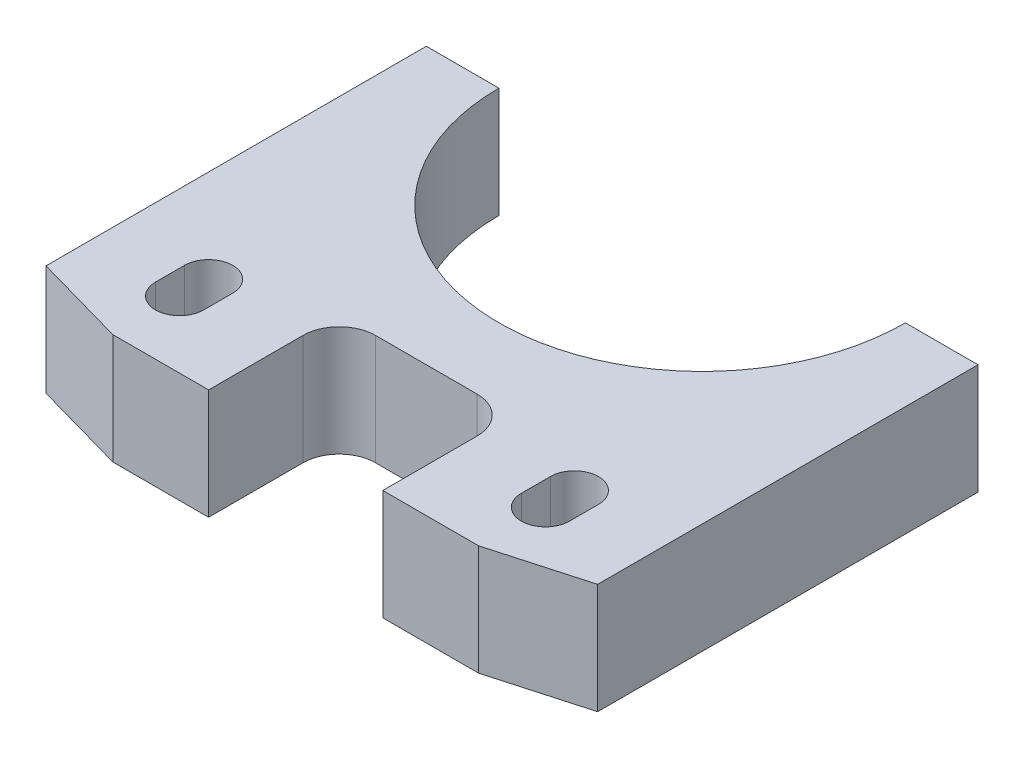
ISO-10303-21;
HEADER;
FILE_DESCRIPTION(('STEP AP214'),'2;1');
FILE_NAME('part.step','',(''),(''),'','','');
FILE_SCHEMA(('AUTOMOTIVE_DESIGN { 1 0 10303 214 1 1 1 1 }'));
ENDSEC;
DATA;
#1=APPLICATION_CONTEXT('core data for automotive mechanical design processes');
#2=APPLICATION_PROTOCOL_DEFINITION('international standard','automotive_design',2000,#1);
#3=PRODUCT_CONTEXT('',#1,'mechanical');
#4=PRODUCT('Part','Part','',(#3));
#5=PRODUCT_RELATED_PRODUCT_CATEGORY('part','',(#4));
#6=PRODUCT_DEFINITION_FORMATION('','',#4);
#7=PRODUCT_DEFINITION_CONTEXT('part definition',#1,'design');
#8=PRODUCT_DEFINITION('design','',#6,#7);
#9=PRODUCT_DEFINITION_SHAPE('','',#8);
#10=(LENGTH_UNIT() NAMED_UNIT(*) SI_UNIT(.MILLI.,.METRE.));
#11=(NAMED_UNIT(*) PLANE_ANGLE_UNIT() SI_UNIT($,.RADIAN.));
#12=(NAMED_UNIT(*) SI_UNIT($,.STERADIAN.) SOLID_ANGLE_UNIT());
#13=UNCERTAINTY_MEASURE_WITH_UNIT(LENGTH_MEASURE(1.E-05),#10,'distance_accuracy_value','');
#14=(GEOMETRIC_REPRESENTATION_CONTEXT(3) GLOBAL_UNCERTAINTY_ASSIGNED_CONTEXT((#13)) GLOBAL_UNIT_ASSIGNED_CONTEXT((#10,
#11,#12)) REPRESENTATION_CONTEXT('',''));
#15=CARTESIAN_POINT('',(0.,0.,0.));
#16=DIRECTION('',(0.,0.,1.));
#17=DIRECTION('',(1.,0.,0.));
#18=AXIS2_PLACEMENT_3D('',#15,#16,#17);
#19=CARTESIAN_POINT('',(0.,9.652,22.86));
#20=DIRECTION('',(0.,1.,0.));
#21=DIRECTION('',(0.,0.,1.));
#22=AXIS2_PLACEMENT_3D('',#19,#20,#21);
#23=PLANE('',#22);
#24=DIRECTION('',(0.,0.,-1.));
#25=VECTOR('',#24,1.);
#26=CARTESIAN_POINT('',(-13.8938,9.652,52.578));
#27=LINE('',#26,#25);
#28=CARTESIAN_POINT('',(-13.8938,9.652,52.578));
#29=VERTEX_POINT('',#28);
#30=CARTESIAN_POINT('',(-13.8938,9.652,50.038));
#31=VERTEX_POINT('',#30);
#32=EDGE_CURVE('E237',#29,#31,#27,.T.);
#33=ORIENTED_EDGE('',*,*,#32,.F.);
#34=CARTESIAN_POINT('',(-16.002,9.652,52.578));
#35=DIRECTION('',(0.,1.,0.));
#36=DIRECTION('',(0.,0.,-1.));
#37=AXIS2_PLACEMENT_3D('',#34,#35,#36);
#38=CIRCLE('',#37,2.1082);
#39=CARTESIAN_POINT('',(-18.1102,9.652,52.578));
#40=VERTEX_POINT('',#39);
#41=EDGE_CURVE('E235',#40,#29,#38,.T.);
#42=ORIENTED_EDGE('',*,*,#41,.F.);
#43=DIRECTION('',(0.,0.,1.));
#44=VECTOR('',#43,1.);
#45=CARTESIAN_POINT('',(-18.1102,9.652,52.578));
#46=LINE('',#45,#44);
#47=CARTESIAN_POINT('',(-18.1102,9.652,50.038));
#48=VERTEX_POINT('',#47);
#49=EDGE_CURVE('E242',#48,#40,#46,.T.);
#50=ORIENTED_EDGE('',*,*,#49,.F.);
#51=CARTESIAN_POINT('',(-16.002,9.652,50.038));
#52=DIRECTION('',(0.,1.,0.));
#53=DIRECTION('',(0.,0.,-1.));
#54=AXIS2_PLACEMENT_3D('',#51,#52,#53);
#55=CIRCLE('',#54,2.1082);
#56=EDGE_CURVE('E239',#31,#48,#55,.T.);
#57=ORIENTED_EDGE('',*,*,#56,.F.);
#58=EDGE_LOOP('',(#33,#42,#50,#57));
#59=FACE_BOUND('',#58,.T.);
#60=CARTESIAN_POINT('',(0.,9.652,22.86));
#61=DIRECTION('',(0.,-1.,0.));
#62=DIRECTION('',(0.,0.,1.));
#63=AXIS2_PLACEMENT_3D('',#60,#61,#62);
#64=CIRCLE('',#63,17.78);
#65=CARTESIAN_POINT('',(17.78,9.652,22.86));
#66=VERTEX_POINT('',#65);
#67=CARTESIAN_POINT('',(-17.78,9.652,22.86));
#68=VERTEX_POINT('',#67);
#69=EDGE_CURVE('E283',#66,#68,#64,.T.);
#70=ORIENTED_EDGE('',*,*,#69,.T.);
#71=DIRECTION('',(-1.,0.,0.));
#72=VECTOR('',#71,1.);
#73=CARTESIAN_POINT('',(-17.78,9.652,22.86));
#74=LINE('',#73,#72);
#75=CARTESIAN_POINT('',(-24.13,9.652,22.86));
#76=VERTEX_POINT('',#75);
#77=EDGE_CURVE('E286',#68,#76,#74,.T.);
#78=ORIENTED_EDGE('',*,*,#77,.T.);
#79=DIRECTION('',(0.,0.,1.));
#80=VECTOR('',#79,1.);
#81=CARTESIAN_POINT('',(-24.13,9.652,22.86));
#82=LINE('',#81,#80);
#83=CARTESIAN_POINT('',(-24.13,9.652,56.134));
#84=VERTEX_POINT('',#83);
#85=EDGE_CURVE('E288',#76,#84,#82,.T.);
#86=ORIENTED_EDGE('',*,*,#85,.T.);
#87=DIRECTION('',(0.962650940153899,0.,0.270745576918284));
#88=VECTOR('',#87,1.);
#89=CARTESIAN_POINT('',(-16.002,9.652,58.42));
#90=LINE('',#89,#88);
#91=CARTESIAN_POINT('',(-16.002,9.652,58.42));
#92=VERTEX_POINT('',#91);
#93=EDGE_CURVE('E290',#84,#92,#90,.T.);
#94=ORIENTED_EDGE('',*,*,#93,.T.);
#95=DIRECTION('',(1.,0.,0.));
#96=VECTOR('',#95,1.);
#97=CARTESIAN_POINT('',(-7.62000000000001,9.652,58.42));
#98=LINE('',#97,#96);
#99=CARTESIAN_POINT('',(-7.62000000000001,9.652,58.42));
#100=VERTEX_POINT('',#99);
#101=EDGE_CURVE('E292',#92,#100,#98,.T.);
#102=ORIENTED_EDGE('',*,*,#101,.T.);
#103=DIRECTION('',(0.,0.,-1.));
#104=VECTOR('',#103,1.);
#105=CARTESIAN_POINT('',(-7.62000000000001,9.652,58.42));
#106=LINE('',#105,#104);
#107=CARTESIAN_POINT('',(-7.62,9.652,50.165));
#108=VERTEX_POINT('',#107);
#109=EDGE_CURVE('E294',#100,#108,#106,.T.);
#110=ORIENTED_EDGE('',*,*,#109,.T.);
#111=CARTESIAN_POINT('',(-4.445,9.652,50.165));
#112=DIRECTION('',(0.,-1.,0.));
#113=DIRECTION('',(0.,0.,-1.));
#114=AXIS2_PLACEMENT_3D('',#111,#112,#113);
#115=CIRCLE('',#114,3.175);
#116=CARTESIAN_POINT('',(-4.445,9.652,46.99));
#117=VERTEX_POINT('',#116);
#118=EDGE_CURVE('E296',#108,#117,#115,.T.);
#119=ORIENTED_EDGE('',*,*,#118,.T.);
#120=DIRECTION('',(1.,0.,0.));
#121=VECTOR('',#120,1.);
#122=CARTESIAN_POINT('',(4.445,9.652,46.99));
#123=LINE('',#122,#121);
#124=CARTESIAN_POINT('',(4.445,9.652,46.99));
#125=VERTEX_POINT('',#124);
#126=EDGE_CURVE('E298',#117,#125,#123,.T.);
#127=ORIENTED_EDGE('',*,*,#126,.T.);
#128=CARTESIAN_POINT('',(4.445,9.652,50.165));
#129=DIRECTION('',(0.,-1.,0.));
#130=DIRECTION('',(0.,0.,1.));
#131=AXIS2_PLACEMENT_3D('',#128,#129,#130);
#132=CIRCLE('',#131,3.175);
#133=CARTESIAN_POINT('',(7.62000000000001,9.652,50.165));
#134=VERTEX_POINT('',#133);
#135=EDGE_CURVE('E300',#125,#134,#132,.T.);
#136=ORIENTED_EDGE('',*,*,#135,.T.);
#137=DIRECTION('',(0.,0.,1.));
#138=VECTOR('',#137,1.);
#139=CARTESIAN_POINT('',(7.62000000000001,9.652,58.42));
#140=LINE('',#139,#138);
#141=CARTESIAN_POINT('',(7.62000000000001,9.652,58.42));
#142=VERTEX_POINT('',#141);
#143=EDGE_CURVE('E302',#134,#142,#140,.T.);
#144=ORIENTED_EDGE('',*,*,#143,.T.);
#145=DIRECTION('',(1.,0.,0.));
#146=VECTOR('',#145,1.);
#147=CARTESIAN_POINT('',(7.62000000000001,9.652,58.42));
#148=LINE('',#147,#146);
#149=CARTESIAN_POINT('',(16.002,9.652,58.42));
#150=VERTEX_POINT('',#149);
#151=EDGE_CURVE('E304',#142,#150,#148,.T.);
#152=ORIENTED_EDGE('',*,*,#151,.T.);
#153=DIRECTION('',(0.962650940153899,0.,-0.270745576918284));
#154=VECTOR('',#153,1.);
#155=CARTESIAN_POINT('',(16.002,9.652,58.42));
#156=LINE('',#155,#154);
#157=CARTESIAN_POINT('',(24.13,9.652,56.134));
#158=VERTEX_POINT('',#157);
#159=EDGE_CURVE('E306',#150,#158,#156,.T.);
#160=ORIENTED_EDGE('',*,*,#159,.T.);
#161=DIRECTION('',(0.,0.,-1.));
#162=VECTOR('',#161,1.);
#163=CARTESIAN_POINT('',(24.13,9.652,22.86));
#164=LINE('',#163,#162);
#165=CARTESIAN_POINT('',(24.13,9.652,22.86));
#166=VERTEX_POINT('',#165);
#167=EDGE_CURVE('E308',#158,#166,#164,.T.);
#168=ORIENTED_EDGE('',*,*,#167,.T.);
#169=DIRECTION('',(-1.,0.,0.));
#170=VECTOR('',#169,1.);
#171=CARTESIAN_POINT('',(17.78,9.652,22.86));
#172=LINE('',#171,#170);
#173=EDGE_CURVE('E310',#166,#66,#172,.T.);
#174=ORIENTED_EDGE('',*,*,#173,.T.);
#175=EDGE_LOOP('',(#70,#78,#86,#94,#102,#110,#119,#127,#136,#144,#152,#160,#168,#174));
#176=FACE_BOUND('',#175,.T.);
#177=DIRECTION('',(0.,0.,-1.));
#178=VECTOR('',#177,1.);
#179=CARTESIAN_POINT('',(18.1102,9.652,52.578));
#180=LINE('',#179,#178);
#181=CARTESIAN_POINT('',(18.1102,9.652,52.578));
#182=VERTEX_POINT('',#181);
#183=CARTESIAN_POINT('',(18.1102,9.652,50.038));
#184=VERTEX_POINT('',#183);
#185=EDGE_CURVE('E214',#182,#184,#180,.T.);
#186=ORIENTED_EDGE('',*,*,#185,.F.);
#187=CARTESIAN_POINT('',(16.002,9.652,52.578));
#188=DIRECTION('',(0.,1.,0.));
#189=DIRECTION('',(0.,0.,1.));
#190=AXIS2_PLACEMENT_3D('',#187,#188,#189);
#191=CIRCLE('',#190,2.1082);
#192=CARTESIAN_POINT('',(13.8938,9.652,52.578));
#193=VERTEX_POINT('',#192);
#194=EDGE_CURVE('E198',#193,#182,#191,.T.);
#195=ORIENTED_EDGE('',*,*,#194,.F.);
#196=DIRECTION('',(0.,0.,1.));
#197=VECTOR('',#196,1.);
#198=CARTESIAN_POINT('',(13.8938,9.652,52.578));
#199=LINE('',#198,#197);
#200=CARTESIAN_POINT('',(13.8938,9.652,50.038));
#201=VERTEX_POINT('',#200);
#202=EDGE_CURVE('E218',#201,#193,#199,.T.);
#203=ORIENTED_EDGE('',*,*,#202,.F.);
#204=CARTESIAN_POINT('',(16.002,9.652,50.038));
#205=DIRECTION('',(0.,1.,0.));
#206=DIRECTION('',(0.,0.,1.));
#207=AXIS2_PLACEMENT_3D('',#204,#205,#206);
#208=CIRCLE('',#207,2.1082);
#209=EDGE_CURVE('E216',#184,#201,#208,.T.);
#210=ORIENTED_EDGE('',*,*,#209,.F.);
#211=EDGE_LOOP('',(#186,#195,#203,#210));
#212=FACE_BOUND('',#211,.T.);
#213=ADVANCED_FACE('F34',(#59,#176,#212),#23,.T.);
#214=CARTESIAN_POINT('',(0.,0.,22.86));
#215=DIRECTION('',(0.,1.,0.));
#216=DIRECTION('',(0.,0.,1.));
#217=AXIS2_PLACEMENT_3D('',#214,#215,#216);
#218=PLANE('',#217);
#219=CARTESIAN_POINT('',(-16.002,0.,52.578));
#220=DIRECTION('',(0.,1.,0.));
#221=DIRECTION('',(0.,0.,-1.));
#222=AXIS2_PLACEMENT_3D('',#219,#220,#221);
#223=CIRCLE('',#222,2.1082);
#224=CARTESIAN_POINT('',(-18.1102,0.,52.578));
#225=VERTEX_POINT('',#224);
#226=CARTESIAN_POINT('',(-13.8938,0.,52.578));
#227=VERTEX_POINT('',#226);
#228=EDGE_CURVE('E199',#225,#227,#223,.T.);
#229=ORIENTED_EDGE('',*,*,#228,.T.);
#230=DIRECTION('',(0.,0.,-1.));
#231=VECTOR('',#230,1.);
#232=CARTESIAN_POINT('',(-13.8938,0.,52.578));
#233=LINE('',#232,#231);
#234=CARTESIAN_POINT('',(-13.8938,0.,50.038));
#235=VERTEX_POINT('',#234);
#236=EDGE_CURVE('E226',#227,#235,#233,.T.);
#237=ORIENTED_EDGE('',*,*,#236,.T.);
#238=CARTESIAN_POINT('',(-16.002,0.,50.038));
#239=DIRECTION('',(0.,1.,0.));
#240=DIRECTION('',(0.,0.,-1.));
#241=AXIS2_PLACEMENT_3D('',#238,#239,#240);
#242=CIRCLE('',#241,2.1082);
#243=CARTESIAN_POINT('',(-18.1102,0.,50.038));
#244=VERTEX_POINT('',#243);
#245=EDGE_CURVE('E229',#235,#244,#242,.T.);
#246=ORIENTED_EDGE('',*,*,#245,.T.);
#247=DIRECTION('',(0.,0.,1.));
#248=VECTOR('',#247,1.);
#249=CARTESIAN_POINT('',(-18.1102,0.,52.578));
#250=LINE('',#249,#248);
#251=EDGE_CURVE('E232',#244,#225,#250,.T.);
#252=ORIENTED_EDGE('',*,*,#251,.T.);
#253=EDGE_LOOP('',(#229,#237,#246,#252));
#254=FACE_BOUND('',#253,.T.);
#255=CARTESIAN_POINT('',(0.,0.,22.86));
#256=DIRECTION('',(0.,-1.,0.));
#257=DIRECTION('',(0.,0.,1.));
#258=AXIS2_PLACEMENT_3D('',#255,#256,#257);
#259=CIRCLE('',#258,17.78);
#260=CARTESIAN_POINT('',(17.78,0.,22.86));
#261=VERTEX_POINT('',#260);
#262=CARTESIAN_POINT('',(-17.78,0.,22.86));
#263=VERTEX_POINT('',#262);
#264=EDGE_CURVE('E254',#261,#263,#259,.T.);
#265=ORIENTED_EDGE('',*,*,#264,.F.);
#266=DIRECTION('',(-1.,0.,0.));
#267=VECTOR('',#266,1.);
#268=CARTESIAN_POINT('',(17.78,0.,22.86));
#269=LINE('',#268,#267);
#270=CARTESIAN_POINT('',(24.13,0.,22.86));
#271=VERTEX_POINT('',#270);
#272=EDGE_CURVE('E281',#271,#261,#269,.T.);
#273=ORIENTED_EDGE('',*,*,#272,.F.);
#274=DIRECTION('',(0.,0.,-1.));
#275=VECTOR('',#274,1.);
#276=CARTESIAN_POINT('',(24.13,0.,22.86));
#277=LINE('',#276,#275);
#278=CARTESIAN_POINT('',(24.13,0.,56.134));
#279=VERTEX_POINT('',#278);
#280=EDGE_CURVE('E279',#279,#271,#277,.T.);
#281=ORIENTED_EDGE('',*,*,#280,.F.);
#282=DIRECTION('',(0.962650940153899,0.,-0.270745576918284));
#283=VECTOR('',#282,1.);
#284=CARTESIAN_POINT('',(16.002,0.,58.42));
#285=LINE('',#284,#283);
#286=CARTESIAN_POINT('',(16.002,0.,58.42));
#287=VERTEX_POINT('',#286);
#288=EDGE_CURVE('E277',#287,#279,#285,.T.);
#289=ORIENTED_EDGE('',*,*,#288,.F.);
#290=DIRECTION('',(1.,0.,0.));
#291=VECTOR('',#290,1.);
#292=CARTESIAN_POINT('',(7.62000000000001,0.,58.42));
#293=LINE('',#292,#291);
#294=CARTESIAN_POINT('',(7.62000000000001,0.,58.42));
#295=VERTEX_POINT('',#294);
#296=EDGE_CURVE('E275',#295,#287,#293,.T.);
#297=ORIENTED_EDGE('',*,*,#296,.F.);
#298=DIRECTION('',(0.,0.,1.));
#299=VECTOR('',#298,1.);
#300=CARTESIAN_POINT('',(7.62000000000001,0.,58.42));
#301=LINE('',#300,#299);
#302=CARTESIAN_POINT('',(7.62000000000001,0.,50.165));
#303=VERTEX_POINT('',#302);
#304=EDGE_CURVE('E273',#303,#295,#301,.T.);
#305=ORIENTED_EDGE('',*,*,#304,.F.);
#306=CARTESIAN_POINT('',(4.445,0.,50.165));
#307=DIRECTION('',(0.,-1.,0.));
#308=DIRECTION('',(0.,0.,1.));
#309=AXIS2_PLACEMENT_3D('',#306,#307,#308);
#310=CIRCLE('',#309,3.175);
#311=CARTESIAN_POINT('',(4.445,0.,46.99));
#312=VERTEX_POINT('',#311);
#313=EDGE_CURVE('E271',#312,#303,#310,.T.);
#314=ORIENTED_EDGE('',*,*,#313,.F.);
#315=DIRECTION('',(1.,0.,0.));
#316=VECTOR('',#315,1.);
#317=CARTESIAN_POINT('',(4.445,0.,46.99));
#318=LINE('',#317,#316);
#319=CARTESIAN_POINT('',(-4.445,0.,46.99));
#320=VERTEX_POINT('',#319);
#321=EDGE_CURVE('E269',#320,#312,#318,.T.);
#322=ORIENTED_EDGE('',*,*,#321,.F.);
#323=CARTESIAN_POINT('',(-4.445,0.,50.165));
#324=DIRECTION('',(0.,-1.,0.));
#325=DIRECTION('',(0.,0.,-1.));
#326=AXIS2_PLACEMENT_3D('',#323,#324,#325);
#327=CIRCLE('',#326,3.175);
#328=CARTESIAN_POINT('',(-7.62,0.,50.165));
#329=VERTEX_POINT('',#328);
#330=EDGE_CURVE('E267',#329,#320,#327,.T.);
#331=ORIENTED_EDGE('',*,*,#330,.F.);
#332=DIRECTION('',(0.,0.,-1.));
#333=VECTOR('',#332,1.);
#334=CARTESIAN_POINT('',(-7.62000000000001,0.,58.42));
#335=LINE('',#334,#333);
#336=CARTESIAN_POINT('',(-7.62000000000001,0.,58.42));
#337=VERTEX_POINT('',#336);
#338=EDGE_CURVE('E265',#337,#329,#335,.T.);
#339=ORIENTED_EDGE('',*,*,#338,.F.);
#340=DIRECTION('',(1.,0.,0.));
#341=VECTOR('',#340,1.);
#342=CARTESIAN_POINT('',(-7.62000000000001,0.,58.42));
#343=LINE('',#342,#341);
#344=CARTESIAN_POINT('',(-16.002,0.,58.42));
#345=VERTEX_POINT('',#344);
#346=EDGE_CURVE('E263',#345,#337,#343,.T.);
#347=ORIENTED_EDGE('',*,*,#346,.F.);
#348=DIRECTION('',(0.962650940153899,0.,0.270745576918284));
#349=VECTOR('',#348,1.);
#350=CARTESIAN_POINT('',(-16.002,0.,58.42));
#351=LINE('',#350,#349);
#352=CARTESIAN_POINT('',(-24.13,0.,56.134));
#353=VERTEX_POINT('',#352);
#354=EDGE_CURVE('E261',#353,#345,#351,.T.);
#355=ORIENTED_EDGE('',*,*,#354,.F.);
#356=DIRECTION('',(0.,0.,1.));
#357=VECTOR('',#356,1.);
#358=CARTESIAN_POINT('',(-24.13,0.,22.86));
#359=LINE('',#358,#357);
#360=CARTESIAN_POINT('',(-24.13,0.,22.86));
#361=VERTEX_POINT('',#360);
#362=EDGE_CURVE('E259',#361,#353,#359,.T.);
#363=ORIENTED_EDGE('',*,*,#362,.F.);
#364=DIRECTION('',(-1.,0.,0.));
#365=VECTOR('',#364,1.);
#366=CARTESIAN_POINT('',(-17.78,0.,22.86));
#367=LINE('',#366,#365);
#368=EDGE_CURVE('E257',#263,#361,#367,.T.);
#369=ORIENTED_EDGE('',*,*,#368,.F.);
#370=EDGE_LOOP('',(#265,#273,#281,#289,#297,#305,#314,#322,#331,#339,#347,#355,#363,#369));
#371=FACE_BOUND('',#370,.T.);
#372=CARTESIAN_POINT('',(16.002,0.,52.578));
#373=DIRECTION('',(0.,1.,0.));
#374=DIRECTION('',(0.,0.,1.));
#375=AXIS2_PLACEMENT_3D('',#372,#373,#374);
#376=CIRCLE('',#375,2.1082);
#377=CARTESIAN_POINT('',(13.8938,0.,52.578));
#378=VERTEX_POINT('',#377);
#379=CARTESIAN_POINT('',(18.1102,0.,52.578));
#380=VERTEX_POINT('',#379);
#381=EDGE_CURVE('E57',#378,#380,#376,.T.);
#382=ORIENTED_EDGE('',*,*,#381,.T.);
#383=DIRECTION('',(0.,0.,-1.));
#384=VECTOR('',#383,1.);
#385=CARTESIAN_POINT('',(18.1102,0.,52.578));
#386=LINE('',#385,#384);
#387=CARTESIAN_POINT('',(18.1102,0.,50.038));
#388=VERTEX_POINT('',#387);
#389=EDGE_CURVE('E185',#380,#388,#386,.T.);
#390=ORIENTED_EDGE('',*,*,#389,.T.);
#391=CARTESIAN_POINT('',(16.002,0.,50.038));
#392=DIRECTION('',(0.,1.,0.));
#393=DIRECTION('',(0.,0.,1.));
#394=AXIS2_PLACEMENT_3D('',#391,#392,#393);
#395=CIRCLE('',#394,2.1082);
#396=CARTESIAN_POINT('',(13.8938,0.,50.038));
#397=VERTEX_POINT('',#396);
#398=EDGE_CURVE('E194',#388,#397,#395,.T.);
#399=ORIENTED_EDGE('',*,*,#398,.T.);
#400=DIRECTION('',(0.,0.,1.));
#401=VECTOR('',#400,1.);
#402=CARTESIAN_POINT('',(13.8938,0.,52.578));
#403=LINE('',#402,#401);
#404=EDGE_CURVE('E203',#397,#378,#403,.T.);
#405=ORIENTED_EDGE('',*,*,#404,.T.);
#406=EDGE_LOOP('',(#382,#390,#399,#405));
#407=FACE_BOUND('',#406,.T.);
#408=ADVANCED_FACE('F202',(#254,#371,#407),#218,.F.);
#409=CARTESIAN_POINT('',(0.,9.652,22.86));
#410=DIRECTION('',(0.,-1.,0.));
#411=DIRECTION('',(0.,0.,-1.));
#412=AXIS2_PLACEMENT_3D('',#409,#410,#411);
#413=CYLINDRICAL_SURFACE('',#412,17.78);
#414=ORIENTED_EDGE('',*,*,#264,.T.);
#415=DIRECTION('',(0.,-1.,0.));
#416=VECTOR('',#415,1.);
#417=CARTESIAN_POINT('',(-17.78,9.652,22.86));
#418=LINE('',#417,#416);
#419=EDGE_CURVE('E11',#68,#263,#418,.T.);
#420=ORIENTED_EDGE('',*,*,#419,.F.);
#421=ORIENTED_EDGE('',*,*,#69,.F.);
#422=DIRECTION('',(0.,-1.,0.));
#423=VECTOR('',#422,1.);
#424=CARTESIAN_POINT('',(17.78,9.652,22.86));
#425=LINE('',#424,#423);
#426=EDGE_CURVE('E312',#66,#261,#425,.T.);
#427=ORIENTED_EDGE('',*,*,#426,.T.);
#428=EDGE_LOOP('',(#414,#420,#421,#427));
#429=FACE_BOUND('',#428,.T.);
#430=ADVANCED_FACE('F36',(#429),#413,.F.);
#431=CARTESIAN_POINT('',(-17.78,9.652,22.86));
#432=DIRECTION('',(0.,0.,1.));
#433=DIRECTION('',(1.,0.,0.));
#434=AXIS2_PLACEMENT_3D('',#431,#432,#433);
#435=PLANE('',#434);
#436=CARTESIAN_POINT('',(-20.828,4.826,22.86));
#437=DIRECTION('',(0.,0.,-1.));
#438=DIRECTION('',(-1.,0.,0.));
#439=AXIS2_PLACEMENT_3D('',#436,#437,#438);
#440=CIRCLE('',#439,1.3589);
#441=CARTESIAN_POINT('',(-22.1869,4.826,22.8599999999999));
#442=VERTEX_POINT('',#441);
#443=EDGE_CURVE('E672',#442,#442,#440,.T.);
#444=ORIENTED_EDGE('',*,*,#443,.F.);
#445=EDGE_LOOP('',(#444));
#446=FACE_BOUND('',#445,.T.);
#447=ORIENTED_EDGE('',*,*,#368,.T.);
#448=DIRECTION('',(0.,-1.,0.));
#449=VECTOR('',#448,1.);
#450=CARTESIAN_POINT('',(-24.13,9.652,22.86));
#451=LINE('',#450,#449);
#452=EDGE_CURVE('E42',#76,#361,#451,.T.);
#453=ORIENTED_EDGE('',*,*,#452,.F.);
#454=ORIENTED_EDGE('',*,*,#77,.F.);
#455=ORIENTED_EDGE('',*,*,#419,.T.);
#456=EDGE_LOOP('',(#447,#453,#454,#455));
#457=FACE_BOUND('',#456,.T.);
#458=ADVANCED_FACE('F374',(#446,#457),#435,.F.);
#459=CARTESIAN_POINT('',(-24.13,9.652,22.86));
#460=DIRECTION('',(1.,0.,0.));
#461=DIRECTION('',(0.,0.,-1.));
#462=AXIS2_PLACEMENT_3D('',#459,#460,#461);
#463=PLANE('',#462);
#464=ORIENTED_EDGE('',*,*,#362,.T.);
#465=DIRECTION('',(0.,-1.,0.));
#466=VECTOR('',#465,1.);
#467=CARTESIAN_POINT('',(-24.13,9.652,56.134));
#468=LINE('',#467,#466);
#469=EDGE_CURVE('E345',#84,#353,#468,.T.);
#470=ORIENTED_EDGE('',*,*,#469,.F.);
#471=ORIENTED_EDGE('',*,*,#85,.F.);
#472=ORIENTED_EDGE('',*,*,#452,.T.);
#473=EDGE_LOOP('',(#464,#470,#471,#472));
#474=FACE_BOUND('',#473,.T.);
#475=ADVANCED_FACE('F352',(#474),#463,.F.);
#476=CARTESIAN_POINT('',(-16.002,9.652,58.42));
#477=DIRECTION('',(0.270745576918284,0.,-0.962650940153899));
#478=DIRECTION('',(-0.962650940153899,0.,-0.270745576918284));
#479=AXIS2_PLACEMENT_3D('',#476,#477,#478);
#480=PLANE('',#479);
#481=ORIENTED_EDGE('',*,*,#354,.T.);
#482=DIRECTION('',(0.,-1.,0.));
#483=VECTOR('',#482,1.);
#484=CARTESIAN_POINT('',(-16.002,9.652,58.42));
#485=LINE('',#484,#483);
#486=EDGE_CURVE('E342',#92,#345,#485,.T.);
#487=ORIENTED_EDGE('',*,*,#486,.F.);
#488=ORIENTED_EDGE('',*,*,#93,.F.);
#489=ORIENTED_EDGE('',*,*,#469,.T.);
#490=EDGE_LOOP('',(#481,#487,#488,#489));
#491=FACE_BOUND('',#490,.T.);
#492=ADVANCED_FACE('F362',(#491),#480,.F.);
#493=CARTESIAN_POINT('',(-7.62000000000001,9.652,58.42));
#494=DIRECTION('',(0.,0.,-1.));
#495=DIRECTION('',(-1.,0.,0.));
#496=AXIS2_PLACEMENT_3D('',#493,#494,#495);
#497=PLANE('',#496);
#498=ORIENTED_EDGE('',*,*,#346,.T.);
#499=DIRECTION('',(0.,-1.,0.));
#500=VECTOR('',#499,1.);
#501=CARTESIAN_POINT('',(-7.62000000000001,9.652,58.42));
#502=LINE('',#501,#500);
#503=EDGE_CURVE('E339',#100,#337,#502,.T.);
#504=ORIENTED_EDGE('',*,*,#503,.F.);
#505=ORIENTED_EDGE('',*,*,#101,.F.);
#506=ORIENTED_EDGE('',*,*,#486,.T.);
#507=EDGE_LOOP('',(#498,#504,#505,#506));
#508=FACE_BOUND('',#507,.T.);
#509=ADVANCED_FACE('F366',(#508),#497,.F.);
#510=CARTESIAN_POINT('',(-7.62000000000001,9.652,58.42));
#511=DIRECTION('',(-1.,0.,0.));
#512=DIRECTION('',(0.,0.,1.));
#513=AXIS2_PLACEMENT_3D('',#510,#511,#512);
#514=PLANE('',#513);
#515=ORIENTED_EDGE('',*,*,#338,.T.);
#516=DIRECTION('',(0.,-1.,0.));
#517=VECTOR('',#516,1.);
#518=CARTESIAN_POINT('',(-7.62,9.652,50.165));
#519=LINE('',#518,#517);
#520=EDGE_CURVE('E336',#108,#329,#519,.T.);
#521=ORIENTED_EDGE('',*,*,#520,.F.);
#522=ORIENTED_EDGE('',*,*,#109,.F.);
#523=ORIENTED_EDGE('',*,*,#503,.T.);
#524=EDGE_LOOP('',(#515,#521,#522,#523));
#525=FACE_BOUND('',#524,.T.);
#526=ADVANCED_FACE('F417',(#525),#514,.F.);
#527=CARTESIAN_POINT('',(-4.445,9.652,50.165));
#528=DIRECTION('',(0.,-1.,0.));
#529=DIRECTION('',(0.,0.,-1.));
#530=AXIS2_PLACEMENT_3D('',#527,#528,#529);
#531=CYLINDRICAL_SURFACE('',#530,3.175);
#532=ORIENTED_EDGE('',*,*,#330,.T.);
#533=DIRECTION('',(0.,-1.,0.));
#534=VECTOR('',#533,1.);
#535=CARTESIAN_POINT('',(-4.445,9.652,46.99));
#536=LINE('',#535,#534);
#537=EDGE_CURVE('E333',#117,#320,#536,.T.);
#538=ORIENTED_EDGE('',*,*,#537,.F.);
#539=ORIENTED_EDGE('',*,*,#118,.F.);
#540=ORIENTED_EDGE('',*,*,#520,.T.);
#541=EDGE_LOOP('',(#532,#538,#539,#540));
#542=FACE_BOUND('',#541,.T.);
#543=ADVANCED_FACE('F415',(#542),#531,.F.);
#544=CARTESIAN_POINT('',(4.445,9.652,46.99));
#545=DIRECTION('',(0.,0.,-1.));
#546=DIRECTION('',(-1.,0.,0.));
#547=AXIS2_PLACEMENT_3D('',#544,#545,#546);
#548=PLANE('',#547);
#549=ORIENTED_EDGE('',*,*,#321,.T.);
#550=DIRECTION('',(0.,-1.,0.));
#551=VECTOR('',#550,1.);
#552=CARTESIAN_POINT('',(4.445,9.652,46.99));
#553=LINE('',#552,#551);
#554=EDGE_CURVE('E330',#125,#312,#553,.T.);
#555=ORIENTED_EDGE('',*,*,#554,.F.);
#556=ORIENTED_EDGE('',*,*,#126,.F.);
#557=ORIENTED_EDGE('',*,*,#537,.T.);
#558=EDGE_LOOP('',(#549,#555,#556,#557));
#559=FACE_BOUND('',#558,.T.);
#560=ADVANCED_FACE('F410',(#559),#548,.F.);
#561=CARTESIAN_POINT('',(4.445,9.652,50.165));
#562=DIRECTION('',(0.,-1.,0.));
#563=DIRECTION('',(0.,0.,-1.));
#564=AXIS2_PLACEMENT_3D('',#561,#562,#563);
#565=CYLINDRICAL_SURFACE('',#564,3.175);
#566=ORIENTED_EDGE('',*,*,#313,.T.);
#567=DIRECTION('',(0.,-1.,0.));
#568=VECTOR('',#567,1.);
#569=CARTESIAN_POINT('',(7.62000000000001,9.652,50.165));
#570=LINE('',#569,#568);
#571=EDGE_CURVE('E327',#134,#303,#570,.T.);
#572=ORIENTED_EDGE('',*,*,#571,.F.);
#573=ORIENTED_EDGE('',*,*,#135,.F.);
#574=ORIENTED_EDGE('',*,*,#554,.T.);
#575=EDGE_LOOP('',(#566,#572,#573,#574));
#576=FACE_BOUND('',#575,.T.);
#577=ADVANCED_FACE('F405',(#576),#565,.F.);
#578=CARTESIAN_POINT('',(7.62000000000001,9.652,58.42));
#579=DIRECTION('',(1.,0.,0.));
#580=DIRECTION('',(0.,0.,-1.));
#581=AXIS2_PLACEMENT_3D('',#578,#579,#580);
#582=PLANE('',#581);
#583=ORIENTED_EDGE('',*,*,#304,.T.);
#584=DIRECTION('',(0.,-1.,0.));
#585=VECTOR('',#584,1.);
#586=CARTESIAN_POINT('',(7.62000000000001,9.652,58.42));
#587=LINE('',#586,#585);
#588=EDGE_CURVE('E324',#142,#295,#587,.T.);
#589=ORIENTED_EDGE('',*,*,#588,.F.);
#590=ORIENTED_EDGE('',*,*,#143,.F.);
#591=ORIENTED_EDGE('',*,*,#571,.T.);
#592=EDGE_LOOP('',(#583,#589,#590,#591));
#593=FACE_BOUND('',#592,.T.);
#594=ADVANCED_FACE('F401',(#593),#582,.F.);
#595=CARTESIAN_POINT('',(7.62000000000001,9.652,58.42));
#596=DIRECTION('',(0.,0.,-1.));
#597=DIRECTION('',(-1.,0.,0.));
#598=AXIS2_PLACEMENT_3D('',#595,#596,#597);
#599=PLANE('',#598);
#600=ORIENTED_EDGE('',*,*,#296,.T.);
#601=DIRECTION('',(0.,-1.,0.));
#602=VECTOR('',#601,1.);
#603=CARTESIAN_POINT('',(16.002,9.652,58.42));
#604=LINE('',#603,#602);
#605=EDGE_CURVE('E321',#150,#287,#604,.T.);
#606=ORIENTED_EDGE('',*,*,#605,.F.);
#607=ORIENTED_EDGE('',*,*,#151,.F.);
#608=ORIENTED_EDGE('',*,*,#588,.T.);
#609=EDGE_LOOP('',(#600,#606,#607,#608));
#610=FACE_BOUND('',#609,.T.);
#611=ADVANCED_FACE('F396',(#610),#599,.F.);
#612=CARTESIAN_POINT('',(16.002,9.652,58.42));
#613=DIRECTION('',(-0.270745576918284,0.,-0.962650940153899));
#614=DIRECTION('',(-0.962650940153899,0.,0.270745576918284));
#615=AXIS2_PLACEMENT_3D('',#612,#613,#614);
#616=PLANE('',#615);
#617=ORIENTED_EDGE('',*,*,#288,.T.);
#618=DIRECTION('',(0.,-1.,0.));
#619=VECTOR('',#618,1.);
#620=CARTESIAN_POINT('',(24.13,9.652,56.134));
#621=LINE('',#620,#619);
#622=EDGE_CURVE('E318',#158,#279,#621,.T.);
#623=ORIENTED_EDGE('',*,*,#622,.F.);
#624=ORIENTED_EDGE('',*,*,#159,.F.);
#625=ORIENTED_EDGE('',*,*,#605,.T.);
#626=EDGE_LOOP('',(#617,#623,#624,#625));
#627=FACE_BOUND('',#626,.T.);
#628=ADVANCED_FACE('F390',(#627),#616,.F.);
#629=CARTESIAN_POINT('',(24.13,9.652,22.86));
#630=DIRECTION('',(-1.,0.,0.));
#631=DIRECTION('',(0.,0.,1.));
#632=AXIS2_PLACEMENT_3D('',#629,#630,#631);
#633=PLANE('',#632);
#634=ORIENTED_EDGE('',*,*,#280,.T.);
#635=DIRECTION('',(0.,-1.,0.));
#636=VECTOR('',#635,1.);
#637=CARTESIAN_POINT('',(24.13,9.652,22.86));
#638=LINE('',#637,#636);
#639=EDGE_CURVE('E315',#166,#271,#638,.T.);
#640=ORIENTED_EDGE('',*,*,#639,.F.);
#641=ORIENTED_EDGE('',*,*,#167,.F.);
#642=ORIENTED_EDGE('',*,*,#622,.T.);
#643=EDGE_LOOP('',(#634,#640,#641,#642));
#644=FACE_BOUND('',#643,.T.);
#645=ADVANCED_FACE('F386',(#644),#633,.F.);
#646=CARTESIAN_POINT('',(17.78,9.652,22.86));
#647=DIRECTION('',(0.,0.,1.));
#648=DIRECTION('',(1.,0.,0.));
#649=AXIS2_PLACEMENT_3D('',#646,#647,#648);
#650=PLANE('',#649);
#651=CARTESIAN_POINT('',(20.8279999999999,4.826,22.86));
#652=DIRECTION('',(0.,0.,-1.));
#653=DIRECTION('',(-1.,0.,0.));
#654=AXIS2_PLACEMENT_3D('',#651,#652,#653);
#655=CIRCLE('',#654,1.3589);
#656=CARTESIAN_POINT('',(19.4691,4.826,22.86));
#657=VERTEX_POINT('',#656);
#658=EDGE_CURVE('E207',#657,#657,#655,.T.);
#659=ORIENTED_EDGE('',*,*,#658,.F.);
#660=EDGE_LOOP('',(#659));
#661=FACE_BOUND('',#660,.T.);
#662=ORIENTED_EDGE('',*,*,#272,.T.);
#663=ORIENTED_EDGE('',*,*,#426,.F.);
#664=ORIENTED_EDGE('',*,*,#173,.F.);
#665=ORIENTED_EDGE('',*,*,#639,.T.);
#666=EDGE_LOOP('',(#662,#663,#664,#665));
#667=FACE_BOUND('',#666,.T.);
#668=ADVANCED_FACE('F381',(#661,#667),#650,.F.);
#669=CARTESIAN_POINT('',(-16.002,9.652,52.578));
#670=DIRECTION('',(0.,-1.,0.));
#671=DIRECTION('',(0.,0.,-1.));
#672=AXIS2_PLACEMENT_3D('',#669,#670,#671);
#673=CYLINDRICAL_SURFACE('',#672,2.1082);
#674=ORIENTED_EDGE('',*,*,#228,.F.);
#675=DIRECTION('',(0.,-1.,0.));
#676=VECTOR('',#675,1.);
#677=CARTESIAN_POINT('',(-18.1102,9.652,52.578));
#678=LINE('',#677,#676);
#679=EDGE_CURVE('E244',#40,#225,#678,.T.);
#680=ORIENTED_EDGE('',*,*,#679,.F.);
#681=ORIENTED_EDGE('',*,*,#41,.T.);
#682=DIRECTION('',(0.,-1.,0.));
#683=VECTOR('',#682,1.);
#684=CARTESIAN_POINT('',(-13.8938,9.652,52.578));
#685=LINE('',#684,#683);
#686=EDGE_CURVE('E251',#29,#227,#685,.T.);
#687=ORIENTED_EDGE('',*,*,#686,.T.);
#688=EDGE_LOOP('',(#674,#680,#681,#687));
#689=FACE_BOUND('',#688,.T.);
#690=ADVANCED_FACE('F439',(#689),#673,.F.);
#691=CARTESIAN_POINT('',(-13.8938,9.652,52.578));
#692=DIRECTION('',(-1.,0.,0.));
#693=DIRECTION('',(0.,0.,1.));
#694=AXIS2_PLACEMENT_3D('',#691,#692,#693);
#695=PLANE('',#694);
#696=ORIENTED_EDGE('',*,*,#236,.F.);
#697=ORIENTED_EDGE('',*,*,#686,.F.);
#698=ORIENTED_EDGE('',*,*,#32,.T.);
#699=DIRECTION('',(0.,-1.,0.));
#700=VECTOR('',#699,1.);
#701=CARTESIAN_POINT('',(-13.8938,9.652,50.038));
#702=LINE('',#701,#700);
#703=EDGE_CURVE('E249',#31,#235,#702,.T.);
#704=ORIENTED_EDGE('',*,*,#703,.T.);
#705=EDGE_LOOP('',(#696,#697,#698,#704));
#706=FACE_BOUND('',#705,.T.);
#707=ADVANCED_FACE('F488',(#706),#695,.T.);
#708=CARTESIAN_POINT('',(-16.002,9.652,50.038));
#709=DIRECTION('',(0.,-1.,0.));
#710=DIRECTION('',(0.,0.,-1.));
#711=AXIS2_PLACEMENT_3D('',#708,#709,#710);
#712=CYLINDRICAL_SURFACE('',#711,2.1082);
#713=ORIENTED_EDGE('',*,*,#245,.F.);
#714=ORIENTED_EDGE('',*,*,#703,.F.);
#715=ORIENTED_EDGE('',*,*,#56,.T.);
#716=DIRECTION('',(0.,-1.,0.));
#717=VECTOR('',#716,1.);
#718=CARTESIAN_POINT('',(-18.1102,9.652,50.038));
#719=LINE('',#718,#717);
#720=EDGE_CURVE('E247',#48,#244,#719,.T.);
#721=ORIENTED_EDGE('',*,*,#720,.T.);
#722=EDGE_LOOP('',(#713,#714,#715,#721));
#723=FACE_BOUND('',#722,.T.);
#724=ADVANCED_FACE('F495',(#723),#712,.F.);
#725=CARTESIAN_POINT('',(-18.1102,9.652,52.578));
#726=DIRECTION('',(1.,0.,0.));
#727=DIRECTION('',(0.,0.,-1.));
#728=AXIS2_PLACEMENT_3D('',#725,#726,#727);
#729=PLANE('',#728);
#730=ORIENTED_EDGE('',*,*,#251,.F.);
#731=ORIENTED_EDGE('',*,*,#720,.F.);
#732=ORIENTED_EDGE('',*,*,#49,.T.);
#733=ORIENTED_EDGE('',*,*,#679,.T.);
#734=EDGE_LOOP('',(#730,#731,#732,#733));
#735=FACE_BOUND('',#734,.T.);
#736=ADVANCED_FACE('F503',(#735),#729,.T.);
#737=CARTESIAN_POINT('',(16.002,9.652,52.578));
#738=DIRECTION('',(0.,-1.,0.));
#739=DIRECTION('',(0.,0.,-1.));
#740=AXIS2_PLACEMENT_3D('',#737,#738,#739);
#741=CYLINDRICAL_SURFACE('',#740,2.1082);
#742=ORIENTED_EDGE('',*,*,#381,.F.);
#743=DIRECTION('',(0.,-1.,0.));
#744=VECTOR('',#743,1.);
#745=CARTESIAN_POINT('',(13.8938,9.652,52.578));
#746=LINE('',#745,#744);
#747=EDGE_CURVE('E220',#193,#378,#746,.T.);
#748=ORIENTED_EDGE('',*,*,#747,.F.);
#749=ORIENTED_EDGE('',*,*,#194,.T.);
#750=DIRECTION('',(0.,-1.,0.));
#751=VECTOR('',#750,1.);
#752=CARTESIAN_POINT('',(18.1102,9.652,52.578));
#753=LINE('',#752,#751);
#754=EDGE_CURVE('E187',#182,#380,#753,.T.);
#755=ORIENTED_EDGE('',*,*,#754,.T.);
#756=EDGE_LOOP('',(#742,#748,#749,#755));
#757=FACE_BOUND('',#756,.T.);
#758=ADVANCED_FACE('F196',(#757),#741,.F.);
#759=CARTESIAN_POINT('',(18.1102,9.652,52.578));
#760=DIRECTION('',(-1.,0.,0.));
#761=DIRECTION('',(0.,0.,1.));
#762=AXIS2_PLACEMENT_3D('',#759,#760,#761);
#763=PLANE('',#762);
#764=ORIENTED_EDGE('',*,*,#389,.F.);
#765=ORIENTED_EDGE('',*,*,#754,.F.);
#766=ORIENTED_EDGE('',*,*,#185,.T.);
#767=DIRECTION('',(0.,-1.,0.));
#768=VECTOR('',#767,1.);
#769=CARTESIAN_POINT('',(18.1102,9.652,50.038));
#770=LINE('',#769,#768);
#771=EDGE_CURVE('E190',#184,#388,#770,.T.);
#772=ORIENTED_EDGE('',*,*,#771,.T.);
#773=EDGE_LOOP('',(#764,#765,#766,#772));
#774=FACE_BOUND('',#773,.T.);
#775=ADVANCED_FACE('F186',(#774),#763,.T.);
#776=CARTESIAN_POINT('',(16.002,9.652,50.038));
#777=DIRECTION('',(0.,-1.,0.));
#778=DIRECTION('',(0.,0.,-1.));
#779=AXIS2_PLACEMENT_3D('',#776,#777,#778);
#780=CYLINDRICAL_SURFACE('',#779,2.1082);
#781=ORIENTED_EDGE('',*,*,#398,.F.);
#782=ORIENTED_EDGE('',*,*,#771,.F.);
#783=ORIENTED_EDGE('',*,*,#209,.T.);
#784=DIRECTION('',(0.,-1.,0.));
#785=VECTOR('',#784,1.);
#786=CARTESIAN_POINT('',(13.8938,9.652,50.038));
#787=LINE('',#786,#785);
#788=EDGE_CURVE('E49',#201,#397,#787,.T.);
#789=ORIENTED_EDGE('',*,*,#788,.T.);
#790=EDGE_LOOP('',(#781,#782,#783,#789));
#791=FACE_BOUND('',#790,.T.);
#792=ADVANCED_FACE('F524',(#791),#780,.F.);
#793=CARTESIAN_POINT('',(13.8938,9.652,52.578));
#794=DIRECTION('',(1.,0.,0.));
#795=DIRECTION('',(0.,0.,-1.));
#796=AXIS2_PLACEMENT_3D('',#793,#794,#795);
#797=PLANE('',#796);
#798=ORIENTED_EDGE('',*,*,#404,.F.);
#799=ORIENTED_EDGE('',*,*,#788,.F.);
#800=ORIENTED_EDGE('',*,*,#202,.T.);
#801=ORIENTED_EDGE('',*,*,#747,.T.);
#802=EDGE_LOOP('',(#798,#799,#800,#801));
#803=FACE_BOUND('',#802,.T.);
#804=ADVANCED_FACE('F531',(#803),#797,.T.);
#805=CARTESIAN_POINT('',(20.8279999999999,4.826,33.782));
#806=DIRECTION('',(0.,0.,-1.));
#807=DIRECTION('',(-1.,0.,0.));
#808=AXIS2_PLACEMENT_3D('',#805,#806,#807);
#809=CYLINDRICAL_SURFACE('',#808,1.3589);
#810=CARTESIAN_POINT('',(20.8279999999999,4.826,33.782));
#811=DIRECTION('',(0.,0.,-1.));
#812=DIRECTION('',(-1.,0.,0.));
#813=AXIS2_PLACEMENT_3D('',#810,#811,#812);
#814=CIRCLE('',#813,1.3589);
#815=CARTESIAN_POINT('',(19.4690999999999,4.826,33.782));
#816=VERTEX_POINT('',#815);
#817=EDGE_CURVE('E204',#816,#816,#814,.T.);
#818=ORIENTED_EDGE('',*,*,#817,.F.);
#819=EDGE_LOOP('',(#818));
#820=FACE_BOUND('',#819,.T.);
#821=ORIENTED_EDGE('',*,*,#658,.T.);
#822=EDGE_LOOP('',(#821));
#823=FACE_BOUND('',#822,.T.);
#824=ADVANCED_FACE('F539',(#820,#823),#809,.F.);
#825=CARTESIAN_POINT('',(20.8279999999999,4.826,33.782));
#826=DIRECTION('',(0.,0.,-1.));
#827=DIRECTION('',(-1.,0.,0.));
#828=AXIS2_PLACEMENT_3D('',#825,#826,#827);
#829=PLANE('',#828);
#830=ORIENTED_EDGE('',*,*,#817,.T.);
#831=EDGE_LOOP('',(#830));
#832=FACE_BOUND('',#831,.T.);
#833=ADVANCED_FACE('F545',(#832),#829,.T.);
#834=CARTESIAN_POINT('',(-20.8280000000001,4.826,33.782));
#835=DIRECTION('',(0.,0.,-1.));
#836=DIRECTION('',(-1.,0.,0.));
#837=AXIS2_PLACEMENT_3D('',#834,#835,#836);
#838=CYLINDRICAL_SURFACE('',#837,1.3589);
#839=CARTESIAN_POINT('',(-20.8280000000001,4.826,33.782));
#840=DIRECTION('',(0.,0.,-1.));
#841=DIRECTION('',(-1.,0.,0.));
#842=AXIS2_PLACEMENT_3D('',#839,#840,#841);
#843=CIRCLE('',#842,1.3589);
#844=CARTESIAN_POINT('',(-22.1869000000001,4.826,33.782));
#845=VERTEX_POINT('',#844);
#846=EDGE_CURVE('E674',#845,#845,#843,.T.);
#847=ORIENTED_EDGE('',*,*,#846,.F.);
#848=EDGE_LOOP('',(#847));
#849=FACE_BOUND('',#848,.T.);
#850=ORIENTED_EDGE('',*,*,#443,.T.);
#851=EDGE_LOOP('',(#850));
#852=FACE_BOUND('',#851,.T.);
#853=ADVANCED_FACE('F553',(#849,#852),#838,.F.);
#854=CARTESIAN_POINT('',(-20.8280000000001,4.826,33.782));
#855=DIRECTION('',(0.,0.,-1.));
#856=DIRECTION('',(-1.,0.,0.));
#857=AXIS2_PLACEMENT_3D('',#854,#855,#856);
#858=PLANE('',#857);
#859=ORIENTED_EDGE('',*,*,#846,.T.);
#860=EDGE_LOOP('',(#859));
#861=FACE_BOUND('',#860,.T.);
#862=ADVANCED_FACE('F561',(#861),#858,.T.);
#863=CLOSED_SHELL('',(#213,#408,#430,#458,#475,#492,#509,#526,#543,#560,#577,#594,#611,#628,
#645,#668,#690,#707,#724,#736,#758,#775,#792,#804,#824,#833,#853,#862));
#864=MANIFOLD_SOLID_BREP('B2',#863);
#865=ADVANCED_BREP_SHAPE_REPRESENTATION('',(#18,#864),#14);
#866=SHAPE_DEFINITION_REPRESENTATION(#9,#865);
ENDSEC;
END-ISO-10303-21;
